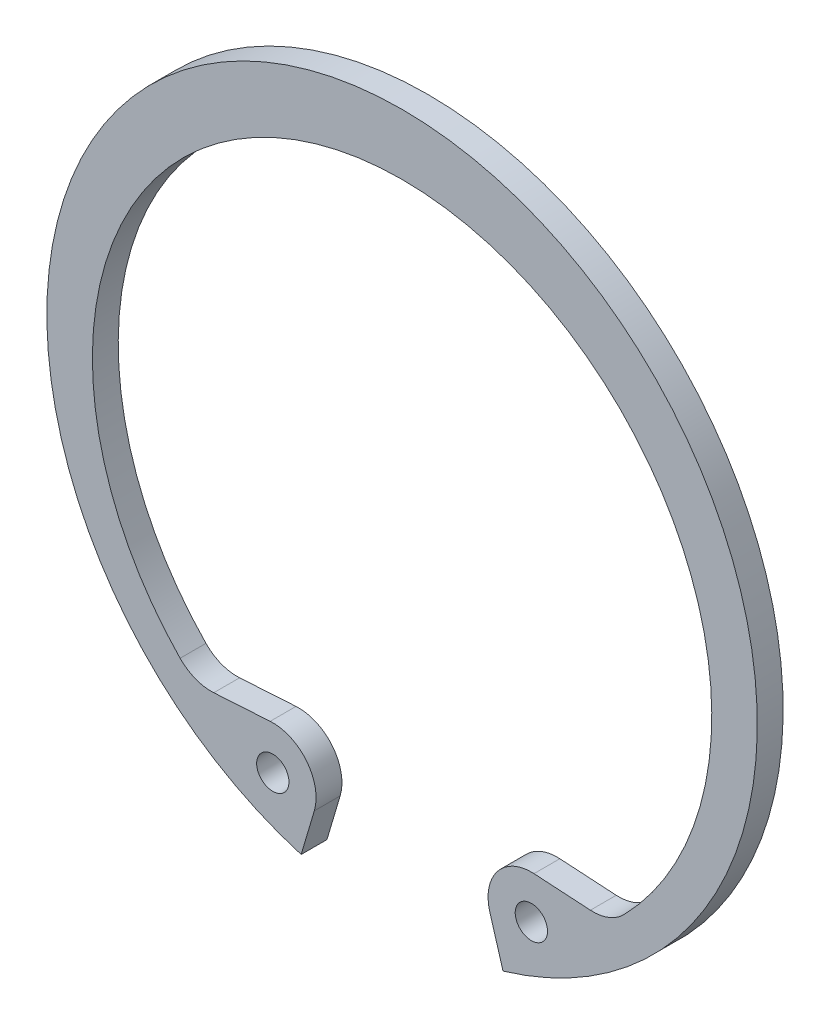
ISO-10303-21;
HEADER;
FILE_DESCRIPTION(('STEP AP214'),'2;1');
FILE_NAME('part.step','',(''),(''),'','','');
FILE_SCHEMA(('AUTOMOTIVE_DESIGN { 1 0 10303 214 1 1 1 1 }'));
ENDSEC;
DATA;
#1=APPLICATION_CONTEXT('core data for automotive mechanical design processes');
#2=APPLICATION_PROTOCOL_DEFINITION('international standard','automotive_design',2000,#1);
#3=PRODUCT_CONTEXT('',#1,'mechanical');
#4=PRODUCT('Part','Part','',(#3));
#5=PRODUCT_RELATED_PRODUCT_CATEGORY('part','',(#4));
#6=PRODUCT_DEFINITION_FORMATION('','',#4);
#7=PRODUCT_DEFINITION_CONTEXT('part definition',#1,'design');
#8=PRODUCT_DEFINITION('design','',#6,#7);
#9=PRODUCT_DEFINITION_SHAPE('','',#8);
#10=(LENGTH_UNIT() NAMED_UNIT(*) SI_UNIT(.MILLI.,.METRE.));
#11=(NAMED_UNIT(*) PLANE_ANGLE_UNIT() SI_UNIT($,.RADIAN.));
#12=(NAMED_UNIT(*) SI_UNIT($,.STERADIAN.) SOLID_ANGLE_UNIT());
#13=UNCERTAINTY_MEASURE_WITH_UNIT(LENGTH_MEASURE(1.E-05),#10,'distance_accuracy_value','');
#14=(GEOMETRIC_REPRESENTATION_CONTEXT(3) GLOBAL_UNCERTAINTY_ASSIGNED_CONTEXT((#13)) GLOBAL_UNIT_ASSIGNED_CONTEXT((#10,
#11,#12)) REPRESENTATION_CONTEXT('',''));
#15=CARTESIAN_POINT('',(0.,0.,0.));
#16=DIRECTION('',(0.,0.,1.));
#17=DIRECTION('',(1.,0.,0.));
#18=AXIS2_PLACEMENT_3D('',#15,#16,#17);
#19=CARTESIAN_POINT('',(0.,0.,2.));
#20=DIRECTION('',(0.,0.,1.));
#21=DIRECTION('',(1.00000000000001,0.,0.));
#22=AXIS2_PLACEMENT_3D('',#19,#20,#21);
#23=PLANE('',#22);
#24=CARTESIAN_POINT('',(10.0081925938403,-21.9785936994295,2.));
#25=DIRECTION('',(0.,0.,1.));
#26=DIRECTION('',(1.00000000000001,0.,0.));
#27=AXIS2_PLACEMENT_3D('',#24,#25,#26);
#28=CIRCLE('',#27,1.25);
#29=CARTESIAN_POINT('',(11.2581925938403,-21.9785936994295,2.));
#30=VERTEX_POINT('',#29);
#31=EDGE_CURVE('E127',#30,#30,#28,.T.);
#32=ORIENTED_EDGE('',*,*,#31,.F.);
#33=EDGE_LOOP('',(#32));
#34=FACE_BOUND('',#33,.T.);
#35=CARTESIAN_POINT('',(0.,0.,2.));
#36=DIRECTION('',(0.,0.,1.));
#37=DIRECTION('',(1.00000000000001,0.,0.));
#38=AXIS2_PLACEMENT_3D('',#35,#36,#37);
#39=CIRCLE('',#38,27.5);
#40=CARTESIAN_POINT('',(7.81460552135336,-26.3663031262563,2.));
#41=VERTEX_POINT('',#40);
#42=CARTESIAN_POINT('',(-7.8146055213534,-26.3663031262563,2.));
#43=VERTEX_POINT('',#42);
#44=EDGE_CURVE('E149',#41,#43,#39,.T.);
#45=ORIENTED_EDGE('',*,*,#44,.T.);
#46=DIRECTION('',(0.284167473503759,0.958774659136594,0.));
#47=VECTOR('',#46,1.);
#48=CARTESIAN_POINT('',(-6.79629748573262,-22.9305547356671,2.));
#49=LINE('',#48,#47);
#50=CARTESIAN_POINT('',(-6.79629748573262,-22.9305547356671,2.));
#51=VERTEX_POINT('',#50);
#52=EDGE_CURVE('E122',#43,#51,#49,.T.);
#53=ORIENTED_EDGE('',*,*,#52,.T.);
#54=CARTESIAN_POINT('',(-10.0081925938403,-21.9785936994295,2.));
#55=DIRECTION('',(0.,0.,1.));
#56=DIRECTION('',(-1.00000000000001,0.,0.));
#57=AXIS2_PLACEMENT_3D('',#54,#55,#56);
#58=CIRCLE('',#57,3.35);
#59=CARTESIAN_POINT('',(-10.2121746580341,-18.634809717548,2.));
#60=VERTEX_POINT('',#59);
#61=EDGE_CURVE('E152',#51,#60,#58,.T.);
#62=ORIENTED_EDGE('',*,*,#61,.T.);
#63=DIRECTION('',(-0.998144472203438,-0.0608901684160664,0.));
#64=VECTOR('',#63,1.);
#65=CARTESIAN_POINT('',(-14.579004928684,-18.9012010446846,2.));
#66=LINE('',#65,#64);
#67=CARTESIAN_POINT('',(-14.579004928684,-18.9012010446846,2.));
#68=VERTEX_POINT('',#67);
#69=EDGE_CURVE('E154',#60,#68,#66,.T.);
#70=ORIENTED_EDGE('',*,*,#69,.T.);
#71=CARTESIAN_POINT('',(-14.7829869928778,-15.5574170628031,2.));
#72=DIRECTION('',(0.,0.,-1.));
#73=DIRECTION('',(-1.00000000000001,0.,0.));
#74=AXIS2_PLACEMENT_3D('',#71,#72,#73);
#75=CIRCLE('',#74,3.35);
#76=CARTESIAN_POINT('',(-17.1841024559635,-17.8934702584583,2.));
#77=VERTEX_POINT('',#76);
#78=EDGE_CURVE('E156',#68,#77,#75,.T.);
#79=ORIENTED_EDGE('',*,*,#78,.T.);
#80=CARTESIAN_POINT('',(0.,-1.175,2.));
#81=DIRECTION('',(0.,0.,-1.));
#82=DIRECTION('',(1.00000000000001,0.,0.));
#83=AXIS2_PLACEMENT_3D('',#80,#81,#82);
#84=CIRCLE('',#83,23.975);
#85=CARTESIAN_POINT('',(17.1841024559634,-17.8934702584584,2.));
#86=VERTEX_POINT('',#85);
#87=EDGE_CURVE('E158',#77,#86,#84,.T.);
#88=ORIENTED_EDGE('',*,*,#87,.T.);
#89=CARTESIAN_POINT('',(14.7829869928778,-15.5574170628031,2.));
#90=DIRECTION('',(0.,0.,-1.));
#91=DIRECTION('',(1.00000000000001,0.,0.));
#92=AXIS2_PLACEMENT_3D('',#89,#90,#91);
#93=CIRCLE('',#92,3.35);
#94=CARTESIAN_POINT('',(14.579004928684,-18.9012010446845,2.));
#95=VERTEX_POINT('',#94);
#96=EDGE_CURVE('E160',#86,#95,#93,.T.);
#97=ORIENTED_EDGE('',*,*,#96,.T.);
#98=DIRECTION('',(-0.998144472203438,0.0608901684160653,0.));
#99=VECTOR('',#98,1.);
#100=CARTESIAN_POINT('',(14.579004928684,-18.9012010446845,2.));
#101=LINE('',#100,#99);
#102=CARTESIAN_POINT('',(10.2121746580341,-18.634809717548,2.));
#103=VERTEX_POINT('',#102);
#104=EDGE_CURVE('E162',#95,#103,#101,.T.);
#105=ORIENTED_EDGE('',*,*,#104,.T.);
#106=CARTESIAN_POINT('',(10.0081925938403,-21.9785936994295,2.));
#107=DIRECTION('',(0.,0.,1.));
#108=DIRECTION('',(1.00000000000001,0.,0.));
#109=AXIS2_PLACEMENT_3D('',#106,#107,#108);
#110=CIRCLE('',#109,3.35);
#111=CARTESIAN_POINT('',(6.79629748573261,-22.9305547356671,2.));
#112=VERTEX_POINT('',#111);
#113=EDGE_CURVE('E51',#103,#112,#110,.T.);
#114=ORIENTED_EDGE('',*,*,#113,.T.);
#115=DIRECTION('',(0.284167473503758,-0.958774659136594,0.));
#116=VECTOR('',#115,1.);
#117=CARTESIAN_POINT('',(6.79629748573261,-22.9305547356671,2.));
#118=LINE('',#117,#116);
#119=EDGE_CURVE('E46',#112,#41,#118,.T.);
#120=ORIENTED_EDGE('',*,*,#119,.T.);
#121=EDGE_LOOP('',(#45,#53,#62,#70,#79,#88,#97,#105,#114,#120));
#122=FACE_BOUND('',#121,.T.);
#123=CARTESIAN_POINT('',(-10.0081925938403,-21.9785936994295,2.));
#124=DIRECTION('',(0.,0.,1.));
#125=DIRECTION('',(-1.00000000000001,0.,0.));
#126=AXIS2_PLACEMENT_3D('',#123,#124,#125);
#127=CIRCLE('',#126,1.25);
#128=CARTESIAN_POINT('',(-11.2581925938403,-21.9785936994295,2.));
#129=VERTEX_POINT('',#128);
#130=EDGE_CURVE('E249',#129,#129,#127,.T.);
#131=ORIENTED_EDGE('',*,*,#130,.F.);
#132=EDGE_LOOP('',(#131));
#133=FACE_BOUND('',#132,.T.);
#134=ADVANCED_FACE('F31',(#34,#122,#133),#23,.T.);
#135=CARTESIAN_POINT('',(0.,0.,0.));
#136=DIRECTION('',(0.,0.,1.));
#137=DIRECTION('',(1.00000000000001,0.,0.));
#138=AXIS2_PLACEMENT_3D('',#135,#136,#137);
#139=PLANE('',#138);
#140=CARTESIAN_POINT('',(10.0081925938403,-21.9785936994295,0.));
#141=DIRECTION('',(0.,0.,1.));
#142=DIRECTION('',(1.00000000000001,0.,0.));
#143=AXIS2_PLACEMENT_3D('',#140,#141,#142);
#144=CIRCLE('',#143,1.25);
#145=CARTESIAN_POINT('',(11.2581925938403,-21.9785936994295,0.));
#146=VERTEX_POINT('',#145);
#147=EDGE_CURVE('E130',#146,#146,#144,.T.);
#148=ORIENTED_EDGE('',*,*,#147,.T.);
#149=EDGE_LOOP('',(#148));
#150=FACE_BOUND('',#149,.T.);
#151=CARTESIAN_POINT('',(0.,0.,0.));
#152=DIRECTION('',(0.,0.,1.));
#153=DIRECTION('',(1.00000000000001,0.,0.));
#154=AXIS2_PLACEMENT_3D('',#151,#152,#153);
#155=CIRCLE('',#154,27.5);
#156=CARTESIAN_POINT('',(7.81460552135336,-26.3663031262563,0.));
#157=VERTEX_POINT('',#156);
#158=CARTESIAN_POINT('',(-7.8146055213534,-26.3663031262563,0.));
#159=VERTEX_POINT('',#158);
#160=EDGE_CURVE('E113',#157,#159,#155,.T.);
#161=ORIENTED_EDGE('',*,*,#160,.F.);
#162=DIRECTION('',(0.284167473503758,-0.958774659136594,0.));
#163=VECTOR('',#162,1.);
#164=CARTESIAN_POINT('',(6.7962974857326,-22.9305547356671,0.));
#165=LINE('',#164,#163);
#166=CARTESIAN_POINT('',(6.7962974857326,-22.9305547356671,0.));
#167=VERTEX_POINT('',#166);
#168=EDGE_CURVE('E147',#167,#157,#165,.T.);
#169=ORIENTED_EDGE('',*,*,#168,.F.);
#170=CARTESIAN_POINT('',(10.0081925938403,-21.9785936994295,0.));
#171=DIRECTION('',(0.,0.,1.));
#172=DIRECTION('',(1.00000000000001,0.,0.));
#173=AXIS2_PLACEMENT_3D('',#170,#171,#172);
#174=CIRCLE('',#173,3.35);
#175=CARTESIAN_POINT('',(10.2121746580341,-18.634809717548,0.));
#176=VERTEX_POINT('',#175);
#177=EDGE_CURVE('E145',#176,#167,#174,.T.);
#178=ORIENTED_EDGE('',*,*,#177,.F.);
#179=DIRECTION('',(-0.998144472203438,0.0608901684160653,0.));
#180=VECTOR('',#179,1.);
#181=CARTESIAN_POINT('',(14.579004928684,-18.9012010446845,0.));
#182=LINE('',#181,#180);
#183=CARTESIAN_POINT('',(14.579004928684,-18.9012010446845,0.));
#184=VERTEX_POINT('',#183);
#185=EDGE_CURVE('E143',#184,#176,#182,.T.);
#186=ORIENTED_EDGE('',*,*,#185,.F.);
#187=CARTESIAN_POINT('',(14.7829869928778,-15.5574170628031,0.));
#188=DIRECTION('',(0.,0.,-1.));
#189=DIRECTION('',(1.00000000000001,0.,0.));
#190=AXIS2_PLACEMENT_3D('',#187,#188,#189);
#191=CIRCLE('',#190,3.35);
#192=CARTESIAN_POINT('',(17.1841024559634,-17.8934702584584,0.));
#193=VERTEX_POINT('',#192);
#194=EDGE_CURVE('E141',#193,#184,#191,.T.);
#195=ORIENTED_EDGE('',*,*,#194,.F.);
#196=CARTESIAN_POINT('',(0.,-1.175,0.));
#197=DIRECTION('',(0.,0.,-1.));
#198=DIRECTION('',(1.00000000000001,0.,0.));
#199=AXIS2_PLACEMENT_3D('',#196,#197,#198);
#200=CIRCLE('',#199,23.975);
#201=CARTESIAN_POINT('',(-17.1841024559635,-17.8934702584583,0.));
#202=VERTEX_POINT('',#201);
#203=EDGE_CURVE('E139',#202,#193,#200,.T.);
#204=ORIENTED_EDGE('',*,*,#203,.F.);
#205=CARTESIAN_POINT('',(-14.7829869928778,-15.5574170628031,0.));
#206=DIRECTION('',(0.,0.,-1.));
#207=DIRECTION('',(-1.00000000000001,0.,0.));
#208=AXIS2_PLACEMENT_3D('',#205,#206,#207);
#209=CIRCLE('',#208,3.35);
#210=CARTESIAN_POINT('',(-14.579004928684,-18.9012010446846,0.));
#211=VERTEX_POINT('',#210);
#212=EDGE_CURVE('E137',#211,#202,#209,.T.);
#213=ORIENTED_EDGE('',*,*,#212,.F.);
#214=DIRECTION('',(-0.998144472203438,-0.0608901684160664,0.));
#215=VECTOR('',#214,1.);
#216=CARTESIAN_POINT('',(-14.579004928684,-18.9012010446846,0.));
#217=LINE('',#216,#215);
#218=CARTESIAN_POINT('',(-10.2121746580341,-18.634809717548,0.));
#219=VERTEX_POINT('',#218);
#220=EDGE_CURVE('E135',#219,#211,#217,.T.);
#221=ORIENTED_EDGE('',*,*,#220,.F.);
#222=CARTESIAN_POINT('',(-10.0081925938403,-21.9785936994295,0.));
#223=DIRECTION('',(0.,0.,1.));
#224=DIRECTION('',(-1.00000000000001,0.,0.));
#225=AXIS2_PLACEMENT_3D('',#222,#223,#224);
#226=CIRCLE('',#225,3.35);
#227=CARTESIAN_POINT('',(-6.79629748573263,-22.9305547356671,0.));
#228=VERTEX_POINT('',#227);
#229=EDGE_CURVE('E115',#228,#219,#226,.T.);
#230=ORIENTED_EDGE('',*,*,#229,.F.);
#231=DIRECTION('',(0.284167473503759,0.958774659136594,0.));
#232=VECTOR('',#231,1.);
#233=CARTESIAN_POINT('',(-6.79629748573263,-22.9305547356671,0.));
#234=LINE('',#233,#232);
#235=EDGE_CURVE('E108',#159,#228,#234,.T.);
#236=ORIENTED_EDGE('',*,*,#235,.F.);
#237=EDGE_LOOP('',(#161,#169,#178,#186,#195,#204,#213,#221,#230,#236));
#238=FACE_BOUND('',#237,.T.);
#239=CARTESIAN_POINT('',(-10.0081925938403,-21.9785936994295,0.));
#240=DIRECTION('',(0.,0.,1.));
#241=DIRECTION('',(-1.00000000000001,0.,0.));
#242=AXIS2_PLACEMENT_3D('',#239,#240,#241);
#243=CIRCLE('',#242,1.25);
#244=CARTESIAN_POINT('',(-11.2581925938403,-21.9785936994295,0.));
#245=VERTEX_POINT('',#244);
#246=EDGE_CURVE('E252',#245,#245,#243,.T.);
#247=ORIENTED_EDGE('',*,*,#246,.T.);
#248=EDGE_LOOP('',(#247));
#249=FACE_BOUND('',#248,.T.);
#250=ADVANCED_FACE('F109',(#150,#238,#249),#139,.F.);
#251=CARTESIAN_POINT('',(0.,0.,2.));
#252=DIRECTION('',(0.,0.,-1.));
#253=DIRECTION('',(-1.00000000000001,0.,0.));
#254=AXIS2_PLACEMENT_3D('',#251,#252,#253);
#255=CYLINDRICAL_SURFACE('',#254,27.5);
#256=ORIENTED_EDGE('',*,*,#160,.T.);
#257=DIRECTION('',(0.,0.,-1.));
#258=VECTOR('',#257,1.);
#259=CARTESIAN_POINT('',(-7.8146055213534,-26.3663031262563,2.));
#260=LINE('',#259,#258);
#261=EDGE_CURVE('E11',#43,#159,#260,.T.);
#262=ORIENTED_EDGE('',*,*,#261,.F.);
#263=ORIENTED_EDGE('',*,*,#44,.F.);
#264=DIRECTION('',(0.,0.,-1.));
#265=VECTOR('',#264,1.);
#266=CARTESIAN_POINT('',(7.81460552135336,-26.3663031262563,2.));
#267=LINE('',#266,#265);
#268=EDGE_CURVE('E126',#41,#157,#267,.T.);
#269=ORIENTED_EDGE('',*,*,#268,.T.);
#270=EDGE_LOOP('',(#256,#262,#263,#269));
#271=FACE_BOUND('',#270,.T.);
#272=ADVANCED_FACE('F33',(#271),#255,.T.);
#273=CARTESIAN_POINT('',(-6.79629748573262,-22.9305547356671,2.));
#274=DIRECTION('',(-0.958774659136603,0.284167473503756,0.));
#275=DIRECTION('',(-0.284167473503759,-0.958774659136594,0.));
#276=AXIS2_PLACEMENT_3D('',#273,#274,#275);
#277=PLANE('',#276);
#278=ORIENTED_EDGE('',*,*,#235,.T.);
#279=DIRECTION('',(0.,0.,-1.));
#280=VECTOR('',#279,1.);
#281=CARTESIAN_POINT('',(-6.79629748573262,-22.9305547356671,2.));
#282=LINE('',#281,#280);
#283=EDGE_CURVE('E39',#51,#228,#282,.T.);
#284=ORIENTED_EDGE('',*,*,#283,.F.);
#285=ORIENTED_EDGE('',*,*,#52,.F.);
#286=ORIENTED_EDGE('',*,*,#261,.T.);
#287=EDGE_LOOP('',(#278,#284,#285,#286));
#288=FACE_BOUND('',#287,.T.);
#289=ADVANCED_FACE('F121',(#288),#277,.F.);
#290=CARTESIAN_POINT('',(-10.0081925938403,-21.9785936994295,2.));
#291=DIRECTION('',(0.,0.,-1.));
#292=DIRECTION('',(-1.00000000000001,0.,0.));
#293=AXIS2_PLACEMENT_3D('',#290,#291,#292);
#294=CYLINDRICAL_SURFACE('',#293,3.35);
#295=ORIENTED_EDGE('',*,*,#229,.T.);
#296=DIRECTION('',(0.,0.,-1.));
#297=VECTOR('',#296,1.);
#298=CARTESIAN_POINT('',(-10.2121746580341,-18.634809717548,2.));
#299=LINE('',#298,#297);
#300=EDGE_CURVE('E185',#60,#219,#299,.T.);
#301=ORIENTED_EDGE('',*,*,#300,.F.);
#302=ORIENTED_EDGE('',*,*,#61,.F.);
#303=ORIENTED_EDGE('',*,*,#283,.T.);
#304=EDGE_LOOP('',(#295,#301,#302,#303));
#305=FACE_BOUND('',#304,.T.);
#306=ADVANCED_FACE('F189',(#305),#294,.T.);
#307=CARTESIAN_POINT('',(-14.579004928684,-18.9012010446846,2.));
#308=DIRECTION('',(0.0608901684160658,-0.99814447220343,0.));
#309=DIRECTION('',(0.998144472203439,0.0608901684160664,0.));
#310=AXIS2_PLACEMENT_3D('',#307,#308,#309);
#311=PLANE('',#310);
#312=ORIENTED_EDGE('',*,*,#220,.T.);
#313=DIRECTION('',(0.,0.,-1.));
#314=VECTOR('',#313,1.);
#315=CARTESIAN_POINT('',(-14.579004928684,-18.9012010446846,2.));
#316=LINE('',#315,#314);
#317=EDGE_CURVE('E182',#68,#211,#316,.T.);
#318=ORIENTED_EDGE('',*,*,#317,.F.);
#319=ORIENTED_EDGE('',*,*,#69,.F.);
#320=ORIENTED_EDGE('',*,*,#300,.T.);
#321=EDGE_LOOP('',(#312,#318,#319,#320));
#322=FACE_BOUND('',#321,.T.);
#323=ADVANCED_FACE('F197',(#322),#311,.F.);
#324=CARTESIAN_POINT('',(-14.7829869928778,-15.5574170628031,2.));
#325=DIRECTION('',(0.,0.,-1.));
#326=DIRECTION('',(-1.00000000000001,0.,0.));
#327=AXIS2_PLACEMENT_3D('',#324,#325,#326);
#328=CYLINDRICAL_SURFACE('',#327,3.35);
#329=ORIENTED_EDGE('',*,*,#212,.T.);
#330=DIRECTION('',(0.,0.,-1.));
#331=VECTOR('',#330,1.);
#332=CARTESIAN_POINT('',(-17.1841024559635,-17.8934702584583,2.));
#333=LINE('',#332,#331);
#334=EDGE_CURVE('E179',#77,#202,#333,.T.);
#335=ORIENTED_EDGE('',*,*,#334,.F.);
#336=ORIENTED_EDGE('',*,*,#78,.F.);
#337=ORIENTED_EDGE('',*,*,#317,.T.);
#338=EDGE_LOOP('',(#329,#335,#336,#337));
#339=FACE_BOUND('',#338,.T.);
#340=ADVANCED_FACE('F200',(#339),#328,.F.);
#341=CARTESIAN_POINT('',(0.,-1.175,2.));
#342=DIRECTION('',(0.,0.,-1.));
#343=DIRECTION('',(-1.00000000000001,0.,0.));
#344=AXIS2_PLACEMENT_3D('',#341,#342,#343);
#345=CYLINDRICAL_SURFACE('',#344,23.975);
#346=ORIENTED_EDGE('',*,*,#203,.T.);
#347=DIRECTION('',(0.,0.,-1.));
#348=VECTOR('',#347,1.);
#349=CARTESIAN_POINT('',(17.1841024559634,-17.8934702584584,2.));
#350=LINE('',#349,#348);
#351=EDGE_CURVE('E176',#86,#193,#350,.T.);
#352=ORIENTED_EDGE('',*,*,#351,.F.);
#353=ORIENTED_EDGE('',*,*,#87,.F.);
#354=ORIENTED_EDGE('',*,*,#334,.T.);
#355=EDGE_LOOP('',(#346,#352,#353,#354));
#356=FACE_BOUND('',#355,.T.);
#357=ADVANCED_FACE('F205',(#356),#345,.F.);
#358=CARTESIAN_POINT('',(14.7829869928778,-15.5574170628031,2.));
#359=DIRECTION('',(0.,0.,-1.));
#360=DIRECTION('',(-1.00000000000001,0.,0.));
#361=AXIS2_PLACEMENT_3D('',#358,#359,#360);
#362=CYLINDRICAL_SURFACE('',#361,3.35);
#363=ORIENTED_EDGE('',*,*,#194,.T.);
#364=DIRECTION('',(0.,0.,-1.));
#365=VECTOR('',#364,1.);
#366=CARTESIAN_POINT('',(14.579004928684,-18.9012010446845,2.));
#367=LINE('',#366,#365);
#368=EDGE_CURVE('E173',#95,#184,#367,.T.);
#369=ORIENTED_EDGE('',*,*,#368,.F.);
#370=ORIENTED_EDGE('',*,*,#96,.F.);
#371=ORIENTED_EDGE('',*,*,#351,.T.);
#372=EDGE_LOOP('',(#363,#369,#370,#371));
#373=FACE_BOUND('',#372,.T.);
#374=ADVANCED_FACE('F211',(#373),#362,.F.);
#375=CARTESIAN_POINT('',(14.579004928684,-18.9012010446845,2.));
#376=DIRECTION('',(-0.0608901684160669,-0.99814447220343,0.));
#377=DIRECTION('',(0.998144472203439,-0.0608901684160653,0.));
#378=AXIS2_PLACEMENT_3D('',#375,#376,#377);
#379=PLANE('',#378);
#380=ORIENTED_EDGE('',*,*,#185,.T.);
#381=DIRECTION('',(0.,0.,-1.));
#382=VECTOR('',#381,1.);
#383=CARTESIAN_POINT('',(10.2121746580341,-18.634809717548,2.));
#384=LINE('',#383,#382);
#385=EDGE_CURVE('E170',#103,#176,#384,.T.);
#386=ORIENTED_EDGE('',*,*,#385,.F.);
#387=ORIENTED_EDGE('',*,*,#104,.F.);
#388=ORIENTED_EDGE('',*,*,#368,.T.);
#389=EDGE_LOOP('',(#380,#386,#387,#388));
#390=FACE_BOUND('',#389,.T.);
#391=ADVANCED_FACE('F215',(#390),#379,.F.);
#392=CARTESIAN_POINT('',(10.0081925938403,-21.9785936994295,2.));
#393=DIRECTION('',(0.,0.,-1.));
#394=DIRECTION('',(-1.00000000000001,0.,0.));
#395=AXIS2_PLACEMENT_3D('',#392,#393,#394);
#396=CYLINDRICAL_SURFACE('',#395,3.35);
#397=ORIENTED_EDGE('',*,*,#177,.T.);
#398=DIRECTION('',(0.,0.,-1.));
#399=VECTOR('',#398,1.);
#400=CARTESIAN_POINT('',(6.79629748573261,-22.9305547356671,2.));
#401=LINE('',#400,#399);
#402=EDGE_CURVE('E167',#112,#167,#401,.T.);
#403=ORIENTED_EDGE('',*,*,#402,.F.);
#404=ORIENTED_EDGE('',*,*,#113,.F.);
#405=ORIENTED_EDGE('',*,*,#385,.T.);
#406=EDGE_LOOP('',(#397,#403,#404,#405));
#407=FACE_BOUND('',#406,.T.);
#408=ADVANCED_FACE('F218',(#407),#396,.T.);
#409=CARTESIAN_POINT('',(6.79629748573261,-22.9305547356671,2.));
#410=DIRECTION('',(0.958774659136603,0.284167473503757,0.));
#411=DIRECTION('',(-0.284167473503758,0.958774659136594,0.));
#412=AXIS2_PLACEMENT_3D('',#409,#410,#411);
#413=PLANE('',#412);
#414=ORIENTED_EDGE('',*,*,#168,.T.);
#415=ORIENTED_EDGE('',*,*,#268,.F.);
#416=ORIENTED_EDGE('',*,*,#119,.F.);
#417=ORIENTED_EDGE('',*,*,#402,.T.);
#418=EDGE_LOOP('',(#414,#415,#416,#417));
#419=FACE_BOUND('',#418,.T.);
#420=ADVANCED_FACE('F220',(#419),#413,.F.);
#421=CARTESIAN_POINT('',(10.0081925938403,-21.9785936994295,2.));
#422=DIRECTION('',(0.,0.,-1.));
#423=DIRECTION('',(-1.00000000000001,0.,0.));
#424=AXIS2_PLACEMENT_3D('',#421,#422,#423);
#425=CYLINDRICAL_SURFACE('',#424,1.25);
#426=ORIENTED_EDGE('',*,*,#31,.T.);
#427=EDGE_LOOP('',(#426));
#428=FACE_BOUND('',#427,.T.);
#429=ORIENTED_EDGE('',*,*,#147,.F.);
#430=EDGE_LOOP('',(#429));
#431=FACE_BOUND('',#430,.T.);
#432=ADVANCED_FACE('F222',(#428,#431),#425,.F.);
#433=CARTESIAN_POINT('',(-10.0081925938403,-21.9785936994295,2.));
#434=DIRECTION('',(0.,0.,-1.));
#435=DIRECTION('',(-1.00000000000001,0.,0.));
#436=AXIS2_PLACEMENT_3D('',#433,#434,#435);
#437=CYLINDRICAL_SURFACE('',#436,1.25);
#438=ORIENTED_EDGE('',*,*,#130,.T.);
#439=EDGE_LOOP('',(#438));
#440=FACE_BOUND('',#439,.T.);
#441=ORIENTED_EDGE('',*,*,#246,.F.);
#442=EDGE_LOOP('',(#441));
#443=FACE_BOUND('',#442,.T.);
#444=ADVANCED_FACE('F228',(#440,#443),#437,.F.);
#445=CLOSED_SHELL('',(#134,#250,#272,#289,#306,#323,#340,#357,#374,#391,#408,#420,#432,#444));
#446=MANIFOLD_SOLID_BREP('B2',#445);
#447=ADVANCED_BREP_SHAPE_REPRESENTATION('',(#18,#446),#14);
#448=SHAPE_DEFINITION_REPRESENTATION(#9,#447);
ENDSEC;
END-ISO-10303-21;
